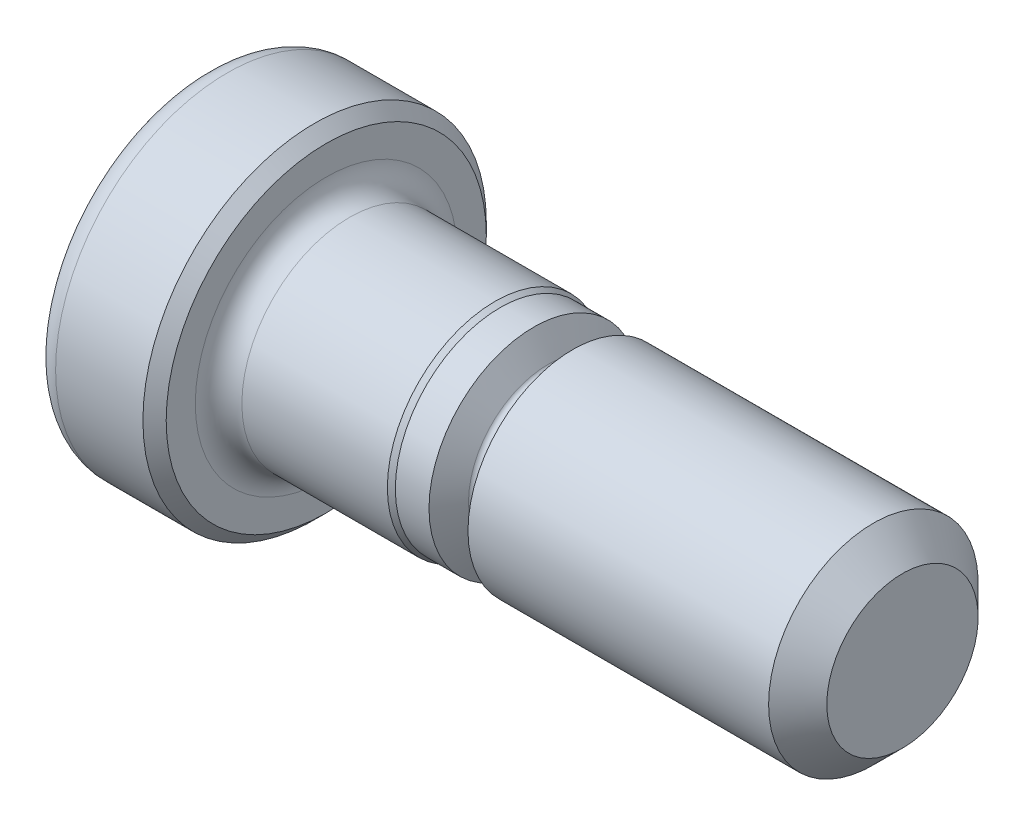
ISO-10303-21;
HEADER;
FILE_DESCRIPTION(('STEP AP214'),'2;1');
FILE_NAME('part.step','',(''),(''),'','','');
FILE_SCHEMA(('AUTOMOTIVE_DESIGN { 1 0 10303 214 1 1 1 1 }'));
ENDSEC;
DATA;
#1=APPLICATION_CONTEXT('core data for automotive mechanical design processes');
#2=APPLICATION_PROTOCOL_DEFINITION('international standard','automotive_design',2000,#1);
#3=PRODUCT_CONTEXT('',#1,'mechanical');
#4=PRODUCT('Part','Part','',(#3));
#5=PRODUCT_RELATED_PRODUCT_CATEGORY('part','',(#4));
#6=PRODUCT_DEFINITION_FORMATION('','',#4);
#7=PRODUCT_DEFINITION_CONTEXT('part definition',#1,'design');
#8=PRODUCT_DEFINITION('design','',#6,#7);
#9=PRODUCT_DEFINITION_SHAPE('','',#8);
#10=(LENGTH_UNIT() NAMED_UNIT(*) SI_UNIT(.MILLI.,.METRE.));
#11=(NAMED_UNIT(*) PLANE_ANGLE_UNIT() SI_UNIT($,.RADIAN.));
#12=(NAMED_UNIT(*) SI_UNIT($,.STERADIAN.) SOLID_ANGLE_UNIT());
#13=UNCERTAINTY_MEASURE_WITH_UNIT(LENGTH_MEASURE(1.E-05),#10,'distance_accuracy_value','');
#14=(GEOMETRIC_REPRESENTATION_CONTEXT(3) GLOBAL_UNCERTAINTY_ASSIGNED_CONTEXT((#13)) GLOBAL_UNIT_ASSIGNED_CONTEXT((#10,
#11,#12)) REPRESENTATION_CONTEXT('',''));
#15=CARTESIAN_POINT('',(0.,0.,0.));
#16=DIRECTION('',(0.,0.,1.));
#17=DIRECTION('',(1.,0.,0.));
#18=AXIS2_PLACEMENT_3D('',#15,#16,#17);
#19=CARTESIAN_POINT('',(0.,0.,0.));
#20=DIRECTION('',(1.,0.,0.));
#21=DIRECTION('',(0.,0.,-1.));
#22=AXIS2_PLACEMENT_3D('',#19,#20,#21);
#23=PLANE('',#22);
#24=CARTESIAN_POINT('',(0.,0.,0.));
#25=DIRECTION('',(1.,0.,0.));
#26=DIRECTION('',(0.,0.,-1.));
#27=AXIS2_PLACEMENT_3D('',#24,#25,#26);
#28=CIRCLE('',#27,1.275);
#29=CARTESIAN_POINT('',(0.,0.,-1.275));
#30=VERTEX_POINT('',#29);
#31=EDGE_CURVE('E290',#30,#30,#28,.F.);
#32=ORIENTED_EDGE('',*,*,#31,.T.);
#33=EDGE_LOOP('',(#32));
#34=FACE_BOUND('',#33,.T.);
#35=CARTESIAN_POINT('',(0.,0.,0.));
#36=DIRECTION('',(-1.,0.,0.));
#37=DIRECTION('',(0.,0.,1.));
#38=AXIS2_PLACEMENT_3D('',#35,#36,#37);
#39=CIRCLE('',#38,0.9);
#40=CARTESIAN_POINT('',(0.,0.,0.9));
#41=VERTEX_POINT('',#40);
#42=EDGE_CURVE('E263',#41,#41,#39,.T.);
#43=ORIENTED_EDGE('',*,*,#42,.F.);
#44=EDGE_LOOP('',(#43));
#45=FACE_BOUND('',#44,.T.);
#46=ADVANCED_FACE('F35',(#34,#45),#23,.F.);
#47=CARTESIAN_POINT('',(6.,0.65,0.));
#48=DIRECTION('',(-1.,0.,0.));
#49=DIRECTION('',(0.,0.,1.));
#50=AXIS2_PLACEMENT_3D('',#47,#48,#49);
#51=PLANE('',#50);
#52=CARTESIAN_POINT('',(6.,0.,0.));
#53=DIRECTION('',(-1.,0.,0.));
#54=DIRECTION('',(0.,0.,1.));
#55=AXIS2_PLACEMENT_3D('',#52,#53,#54);
#56=CIRCLE('',#55,0.65);
#57=CARTESIAN_POINT('',(6.,0.,0.65));
#58=VERTEX_POINT('',#57);
#59=EDGE_CURVE('E287',#58,#58,#56,.T.);
#60=ORIENTED_EDGE('',*,*,#59,.F.);
#61=EDGE_LOOP('',(#60));
#62=FACE_BOUND('',#61,.T.);
#63=ADVANCED_FACE('F402',(#62),#51,.F.);
#64=CARTESIAN_POINT('',(6.,0.,0.));
#65=DIRECTION('',(-1.,0.,0.));
#66=DIRECTION('',(0.,0.,1.));
#67=AXIS2_PLACEMENT_3D('',#64,#65,#66);
#68=CONICAL_SURFACE('',#67,0.65,0.785398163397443);
#69=CARTESIAN_POINT('',(5.75,0.,0.));
#70=DIRECTION('',(-1.,0.,0.));
#71=DIRECTION('',(0.,0.,1.));
#72=AXIS2_PLACEMENT_3D('',#69,#70,#71);
#73=CIRCLE('',#72,0.9);
#74=CARTESIAN_POINT('',(5.75,0.,0.9));
#75=VERTEX_POINT('',#74);
#76=EDGE_CURVE('E284',#75,#75,#73,.T.);
#77=ORIENTED_EDGE('',*,*,#76,.F.);
#78=EDGE_LOOP('',(#77));
#79=FACE_BOUND('',#78,.T.);
#80=ORIENTED_EDGE('',*,*,#59,.T.);
#81=EDGE_LOOP('',(#80));
#82=FACE_BOUND('',#81,.T.);
#83=ADVANCED_FACE('F407',(#79,#82),#68,.T.);
#84=CARTESIAN_POINT('',(0.,0.,0.));
#85=DIRECTION('',(-1.,0.,0.));
#86=DIRECTION('',(0.,0.,1.));
#87=AXIS2_PLACEMENT_3D('',#84,#85,#86);
#88=CYLINDRICAL_SURFACE('',#87,0.9);
#89=CARTESIAN_POINT('',(3.16743157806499,0.,0.));
#90=DIRECTION('',(-1.,0.,0.));
#91=DIRECTION('',(0.,0.,1.));
#92=AXIS2_PLACEMENT_3D('',#89,#90,#91);
#93=CIRCLE('',#92,0.9);
#94=CARTESIAN_POINT('',(3.16743157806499,0.,0.9));
#95=VERTEX_POINT('',#94);
#96=EDGE_CURVE('E281',#95,#95,#93,.T.);
#97=ORIENTED_EDGE('',*,*,#96,.F.);
#98=EDGE_LOOP('',(#97));
#99=FACE_BOUND('',#98,.T.);
#100=ORIENTED_EDGE('',*,*,#76,.T.);
#101=EDGE_LOOP('',(#100));
#102=FACE_BOUND('',#101,.T.);
#103=ADVANCED_FACE('F444',(#99,#102),#88,.T.);
#104=CARTESIAN_POINT('',(3.16743157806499,0.,0.));
#105=DIRECTION('',(1.,0.,0.));
#106=DIRECTION('',(0.,0.,-1.));
#107=AXIS2_PLACEMENT_3D('',#104,#105,#106);
#108=CONICAL_SURFACE('',#107,0.9,1.0471975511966);
#109=CARTESIAN_POINT('',(3.04330127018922,0.,0.));
#110=DIRECTION('',(-1.,0.,0.));
#111=DIRECTION('',(0.,0.,1.));
#112=AXIS2_PLACEMENT_3D('',#109,#110,#111);
#113=CIRCLE('',#112,0.685);
#114=CARTESIAN_POINT('',(3.04330127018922,0.,0.685));
#115=VERTEX_POINT('',#114);
#116=EDGE_CURVE('E278',#115,#115,#113,.T.);
#117=ORIENTED_EDGE('',*,*,#116,.F.);
#118=EDGE_LOOP('',(#117));
#119=FACE_BOUND('',#118,.T.);
#120=ORIENTED_EDGE('',*,*,#96,.T.);
#121=EDGE_LOOP('',(#120));
#122=FACE_BOUND('',#121,.T.);
#123=ADVANCED_FACE('F440',(#119,#122),#108,.T.);
#124=CARTESIAN_POINT('',(3.,0.,0.));
#125=DIRECTION('',(-1.,0.,0.));
#126=DIRECTION('',(0.,0.,1.));
#127=AXIS2_PLACEMENT_3D('',#124,#125,#126);
#128=TOROIDAL_SURFACE('',#127,0.71,0.0500000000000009);
#129=CARTESIAN_POINT('',(2.95669872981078,0.,0.));
#130=DIRECTION('',(-1.,0.,0.));
#131=DIRECTION('',(0.,0.,1.));
#132=AXIS2_PLACEMENT_3D('',#129,#130,#131);
#133=CIRCLE('',#132,0.685);
#134=CARTESIAN_POINT('',(2.95669872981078,0.,0.685));
#135=VERTEX_POINT('',#134);
#136=EDGE_CURVE('E275',#135,#135,#133,.T.);
#137=ORIENTED_EDGE('',*,*,#136,.F.);
#138=EDGE_LOOP('',(#137));
#139=FACE_BOUND('',#138,.T.);
#140=ORIENTED_EDGE('',*,*,#116,.T.);
#141=EDGE_LOOP('',(#140));
#142=FACE_BOUND('',#141,.T.);
#143=ADVANCED_FACE('F436',(#139,#142),#128,.F.);
#144=CARTESIAN_POINT('',(2.95669872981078,0.,0.));
#145=DIRECTION('',(-1.,0.,0.));
#146=DIRECTION('',(0.,0.,1.));
#147=AXIS2_PLACEMENT_3D('',#144,#145,#146);
#148=CONICAL_SURFACE('',#147,0.685,1.0471975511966);
#149=CARTESIAN_POINT('',(2.83256842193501,0.,0.));
#150=DIRECTION('',(-1.,0.,0.));
#151=DIRECTION('',(0.,0.,1.));
#152=AXIS2_PLACEMENT_3D('',#149,#150,#151);
#153=CIRCLE('',#152,0.9);
#154=CARTESIAN_POINT('',(2.83256842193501,0.,0.9));
#155=VERTEX_POINT('',#154);
#156=EDGE_CURVE('E272',#155,#155,#153,.T.);
#157=ORIENTED_EDGE('',*,*,#156,.F.);
#158=EDGE_LOOP('',(#157));
#159=FACE_BOUND('',#158,.T.);
#160=ORIENTED_EDGE('',*,*,#136,.T.);
#161=EDGE_LOOP('',(#160));
#162=FACE_BOUND('',#161,.T.);
#163=ADVANCED_FACE('F432',(#159,#162),#148,.T.);
#164=CARTESIAN_POINT('',(0.,0.,0.));
#165=DIRECTION('',(-1.,0.,0.));
#166=DIRECTION('',(0.,0.,1.));
#167=AXIS2_PLACEMENT_3D('',#164,#165,#166);
#168=CYLINDRICAL_SURFACE('',#167,0.9);
#169=CARTESIAN_POINT('',(2.54330127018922,0.,0.));
#170=DIRECTION('',(-1.,0.,0.));
#171=DIRECTION('',(0.,0.,1.));
#172=AXIS2_PLACEMENT_3D('',#169,#170,#171);
#173=CIRCLE('',#172,0.9);
#174=CARTESIAN_POINT('',(2.54330127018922,0.,0.9));
#175=VERTEX_POINT('',#174);
#176=EDGE_CURVE('E269',#175,#175,#173,.T.);
#177=ORIENTED_EDGE('',*,*,#176,.F.);
#178=EDGE_LOOP('',(#177));
#179=FACE_BOUND('',#178,.T.);
#180=ORIENTED_EDGE('',*,*,#156,.T.);
#181=EDGE_LOOP('',(#180));
#182=FACE_BOUND('',#181,.T.);
#183=ADVANCED_FACE('F428',(#179,#182),#168,.T.);
#184=CARTESIAN_POINT('',(2.54330127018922,0.,0.));
#185=DIRECTION('',(-1.,0.,0.));
#186=DIRECTION('',(0.,0.,1.));
#187=AXIS2_PLACEMENT_3D('',#184,#185,#186);
#188=CONICAL_SURFACE('',#187,0.9,0.523598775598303);
#189=CARTESIAN_POINT('',(2.5,0.,0.));
#190=DIRECTION('',(-1.,0.,0.));
#191=DIRECTION('',(0.,0.,1.));
#192=AXIS2_PLACEMENT_3D('',#189,#190,#191);
#193=CIRCLE('',#192,0.925);
#194=CARTESIAN_POINT('',(2.5,0.,0.925));
#195=VERTEX_POINT('',#194);
#196=EDGE_CURVE('E266',#195,#195,#193,.T.);
#197=ORIENTED_EDGE('',*,*,#196,.F.);
#198=EDGE_LOOP('',(#197));
#199=FACE_BOUND('',#198,.T.);
#200=ORIENTED_EDGE('',*,*,#176,.T.);
#201=EDGE_LOOP('',(#200));
#202=FACE_BOUND('',#201,.T.);
#203=ADVANCED_FACE('F424',(#199,#202),#188,.T.);
#204=CARTESIAN_POINT('',(0.,0.,0.));
#205=DIRECTION('',(-1.,0.,0.));
#206=DIRECTION('',(0.,0.,1.));
#207=AXIS2_PLACEMENT_3D('',#204,#205,#206);
#208=CYLINDRICAL_SURFACE('',#207,0.925);
#209=CARTESIAN_POINT('',(1.25,0.,0.));
#210=DIRECTION('',(-1.,0.,0.));
#211=DIRECTION('',(0.,0.,1.));
#212=AXIS2_PLACEMENT_3D('',#209,#210,#211);
#213=CIRCLE('',#212,0.925);
#214=CARTESIAN_POINT('',(1.25,0.,0.925));
#215=VERTEX_POINT('',#214);
#216=EDGE_CURVE('E299',#215,#215,#213,.F.);
#217=ORIENTED_EDGE('',*,*,#216,.T.);
#218=EDGE_LOOP('',(#217));
#219=FACE_BOUND('',#218,.T.);
#220=ORIENTED_EDGE('',*,*,#196,.T.);
#221=EDGE_LOOP('',(#220));
#222=FACE_BOUND('',#221,.T.);
#223=ADVANCED_FACE('F420',(#219,#222),#208,.T.);
#224=CARTESIAN_POINT('',(1.05,1.475,0.));
#225=DIRECTION('',(-1.,0.,0.));
#226=DIRECTION('',(0.,0.,1.));
#227=AXIS2_PLACEMENT_3D('',#224,#225,#226);
#228=PLANE('',#227);
#229=CARTESIAN_POINT('',(1.05,0.,0.));
#230=DIRECTION('',(-1.,0.,0.));
#231=DIRECTION('',(0.,0.,1.));
#232=AXIS2_PLACEMENT_3D('',#229,#230,#231);
#233=CIRCLE('',#232,1.375);
#234=CARTESIAN_POINT('',(1.05,0.,1.375));
#235=VERTEX_POINT('',#234);
#236=EDGE_CURVE('E305',#235,#235,#233,.F.);
#237=ORIENTED_EDGE('',*,*,#236,.T.);
#238=EDGE_LOOP('',(#237));
#239=FACE_BOUND('',#238,.T.);
#240=CARTESIAN_POINT('',(1.05,0.,0.));
#241=DIRECTION('',(-1.,0.,0.));
#242=DIRECTION('',(0.,0.,1.));
#243=AXIS2_PLACEMENT_3D('',#240,#241,#242);
#244=CIRCLE('',#243,1.125);
#245=CARTESIAN_POINT('',(1.05,0.,1.125));
#246=VERTEX_POINT('',#245);
#247=EDGE_CURVE('E296',#246,#246,#244,.T.);
#248=ORIENTED_EDGE('',*,*,#247,.T.);
#249=EDGE_LOOP('',(#248));
#250=FACE_BOUND('',#249,.T.);
#251=ADVANCED_FACE('F416',(#239,#250),#228,.F.);
#252=CARTESIAN_POINT('',(0.,0.,0.));
#253=DIRECTION('',(-1.,0.,0.));
#254=DIRECTION('',(0.,0.,1.));
#255=AXIS2_PLACEMENT_3D('',#252,#253,#254);
#256=CYLINDRICAL_SURFACE('',#255,1.475);
#257=CARTESIAN_POINT('',(0.95,0.,0.));
#258=DIRECTION('',(-1.,0.,0.));
#259=DIRECTION('',(0.,0.,1.));
#260=AXIS2_PLACEMENT_3D('',#257,#258,#259);
#261=CIRCLE('',#260,1.475);
#262=CARTESIAN_POINT('',(0.95,0.,1.475));
#263=VERTEX_POINT('',#262);
#264=EDGE_CURVE('E302',#263,#263,#261,.T.);
#265=ORIENTED_EDGE('',*,*,#264,.T.);
#266=EDGE_LOOP('',(#265));
#267=FACE_BOUND('',#266,.T.);
#268=CARTESIAN_POINT('',(0.2,0.,0.));
#269=DIRECTION('',(1.,0.,0.));
#270=DIRECTION('',(0.,0.,-1.));
#271=AXIS2_PLACEMENT_3D('',#268,#269,#270);
#272=CIRCLE('',#271,1.475);
#273=CARTESIAN_POINT('',(0.2,0.,-1.475));
#274=VERTEX_POINT('',#273);
#275=EDGE_CURVE('E293',#274,#274,#272,.T.);
#276=ORIENTED_EDGE('',*,*,#275,.T.);
#277=EDGE_LOOP('',(#276));
#278=FACE_BOUND('',#277,.T.);
#279=ADVANCED_FACE('F412',(#267,#278),#256,.T.);
#280=CARTESIAN_POINT('',(0.2,0.,0.));
#281=DIRECTION('',(1.,0.,0.));
#282=DIRECTION('',(0.,0.,-1.));
#283=AXIS2_PLACEMENT_3D('',#280,#281,#282);
#284=TOROIDAL_SURFACE('',#283,1.275,0.2);
#285=ORIENTED_EDGE('',*,*,#275,.F.);
#286=EDGE_LOOP('',(#285));
#287=FACE_BOUND('',#286,.T.);
#288=ORIENTED_EDGE('',*,*,#31,.F.);
#289=EDGE_LOOP('',(#288));
#290=FACE_BOUND('',#289,.T.);
#291=ADVANCED_FACE('F415',(#287,#290),#284,.T.);
#292=CARTESIAN_POINT('',(1.25,0.,0.));
#293=DIRECTION('',(-1.,0.,0.));
#294=DIRECTION('',(0.,0.,1.));
#295=AXIS2_PLACEMENT_3D('',#292,#293,#294);
#296=TOROIDAL_SURFACE('',#295,1.125,0.2);
#297=ORIENTED_EDGE('',*,*,#216,.F.);
#298=EDGE_LOOP('',(#297));
#299=FACE_BOUND('',#298,.T.);
#300=ORIENTED_EDGE('',*,*,#247,.F.);
#301=EDGE_LOOP('',(#300));
#302=FACE_BOUND('',#301,.T.);
#303=ADVANCED_FACE('F453',(#299,#302),#296,.F.);
#304=CARTESIAN_POINT('',(0.95,0.,0.));
#305=DIRECTION('',(-1.,0.,0.));
#306=DIRECTION('',(0.,0.,1.));
#307=AXIS2_PLACEMENT_3D('',#304,#305,#306);
#308=CONICAL_SURFACE('',#307,1.475,0.785398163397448);
#309=ORIENTED_EDGE('',*,*,#236,.F.);
#310=EDGE_LOOP('',(#309));
#311=FACE_BOUND('',#310,.T.);
#312=ORIENTED_EDGE('',*,*,#264,.F.);
#313=EDGE_LOOP('',(#312));
#314=FACE_BOUND('',#313,.T.);
#315=ADVANCED_FACE('F37',(#311,#314),#308,.T.);
#316=CARTESIAN_POINT('',(0.249999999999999,0.,0.));
#317=DIRECTION('',(-1.,0.,0.));
#318=DIRECTION('',(0.,0.,1.));
#319=AXIS2_PLACEMENT_3D('',#316,#317,#318);
#320=CONICAL_SURFACE('',#319,0.65,0.78539816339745);
#321=CARTESIAN_POINT('',(-0.212714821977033,0.0991369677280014,1.10828973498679));
#322=CARTESIAN_POINT('',(-0.184792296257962,0.116220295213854,1.07870054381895));
#323=CARTESIAN_POINT('',(-0.157145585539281,0.133421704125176,1.04890682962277));
#324=CARTESIAN_POINT('',(-0.102654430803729,0.168186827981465,0.988691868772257));
#325=CARTESIAN_POINT('',(-0.0758114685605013,0.185751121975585,0.958269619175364));
#326=CARTESIAN_POINT('',(-0.0226460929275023,0.221736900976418,0.895940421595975));
#327=CARTESIAN_POINT('',(0.00364827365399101,0.240168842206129,0.864015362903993));
#328=CARTESIAN_POINT('',(0.0544559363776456,0.27762357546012,0.799141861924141));
#329=CARTESIAN_POINT('',(0.0789704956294,0.296645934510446,0.766194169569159));
#330=CARTESIAN_POINT('',(0.128418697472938,0.338044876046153,0.69448909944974));
#331=CARTESIAN_POINT('',(0.152984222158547,0.360533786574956,0.655537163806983));
#332=CARTESIAN_POINT('',(0.196462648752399,0.40676600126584,0.575460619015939));
#333=CARTESIAN_POINT('',(0.215405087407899,0.430501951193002,0.534348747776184));
#334=CARTESIAN_POINT('',(0.240821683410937,0.47339976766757,0.460047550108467));
#335=CARTESIAN_POINT('',(0.2492097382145,0.49226588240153,0.427370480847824));
#336=CARTESIAN_POINT('',(0.259330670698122,0.53041549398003,0.361293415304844));
#337=CARTESIAN_POINT('',(0.261081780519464,0.549697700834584,0.327895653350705));
#338=CARTESIAN_POINT('',(0.257580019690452,0.588087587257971,0.261402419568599));
#339=CARTESIAN_POINT('',(0.25232855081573,0.607195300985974,0.228306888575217));
#340=CARTESIAN_POINT('',(0.23589971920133,0.644796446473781,0.163179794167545));
#341=CARTESIAN_POINT('',(0.224701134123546,0.663287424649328,0.131152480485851));
#342=CARTESIAN_POINT('',(0.194819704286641,0.703774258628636,0.0610272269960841));
#343=CARTESIAN_POINT('',(0.174987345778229,0.725550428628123,0.0233097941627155));
#344=CARTESIAN_POINT('',(0.131167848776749,0.768050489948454,-0.050302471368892));
#345=CARTESIAN_POINT('',(0.107171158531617,0.788771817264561,-0.086192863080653));
#346=CARTESIAN_POINT('',(0.0564162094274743,0.829506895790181,-0.156748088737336));
#347=CARTESIAN_POINT('',(0.0296425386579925,0.849515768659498,-0.191404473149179));
#348=CARTESIAN_POINT('',(-0.0256130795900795,0.888899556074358,-0.259619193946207));
#349=CARTESIAN_POINT('',(-0.0540934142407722,0.908275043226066,-0.293178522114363));
#350=CARTESIAN_POINT('',(-0.104310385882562,0.941350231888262,-0.350466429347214));
#351=CARTESIAN_POINT('',(-0.125767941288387,0.955156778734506,-0.374380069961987));
#352=CARTESIAN_POINT('',(-0.168997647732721,0.98245810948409,-0.42166736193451));
#353=CARTESIAN_POINT('',(-0.190765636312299,0.995954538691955,-0.445043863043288));
#354=CARTESIAN_POINT('',(-0.212714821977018,1.00937554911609,-0.468289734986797));
#355=B_SPLINE_CURVE_WITH_KNOTS('',3,(#321,#322,#323,#324,#325,#326,#327,#328,#329,#330,#331,
#332,#333,#334,#335,#336,#337,#338,#339,#340,#341,#342,#343,#344,#345,#346,#347,#348,#349,#350,
#351,#352,#353,#354),.UNSPECIFIED.,.F.,.F.,(4,2,2,2,2,2,2,2,2,2,2,2,2,2,2,2,4),(0.,
0.132386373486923,0.265003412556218,0.400810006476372,0.536519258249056,0.690058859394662,
0.842777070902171,0.958260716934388,1.07342689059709,1.1885700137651,1.3041268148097,
1.44732611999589,1.59085833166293,1.73523471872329,1.87947675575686,1.98438169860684,
2.08840453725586),.UNSPECIFIED.);
#356=CARTESIAN_POINT('',(0.160991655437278,0.369504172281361,0.64));
#357=VERTEX_POINT('',#356);
#358=CARTESIAN_POINT('',(0.249999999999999,0.497467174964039,0.418361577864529));
#359=VERTEX_POINT('',#358);
#360=EDGE_CURVE('E242',#357,#359,#355,.T.);
#361=ORIENTED_EDGE('',*,*,#360,.F.);
#362=CARTESIAN_POINT('',(-0.15427635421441,-0.837793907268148,0.64));
#363=CARTESIAN_POINT('',(-0.125480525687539,-0.801499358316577,0.64));
#364=CARTESIAN_POINT('',(-0.0970433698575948,-0.764897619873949,0.64));
#365=CARTESIAN_POINT('',(-0.0412546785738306,-0.690643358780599,0.64));
#366=CARTESIAN_POINT('',(-0.0139080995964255,-0.65298712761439,0.64));
#367=CARTESIAN_POINT('',(0.0401547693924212,-0.574938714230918,0.64));
#368=CARTESIAN_POINT('',(0.0668011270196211,-0.534497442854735,0.64));
#369=CARTESIAN_POINT('',(0.117212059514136,-0.451916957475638,0.64));
#370=CARTESIAN_POINT('',(0.140981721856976,-0.409780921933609,0.64));
#371=CARTESIAN_POINT('',(0.182221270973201,-0.326791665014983,0.64));
#372=CARTESIAN_POINT('',(0.200050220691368,-0.286122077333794,0.64));
#373=CARTESIAN_POINT('',(0.229700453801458,-0.202941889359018,0.64));
#374=CARTESIAN_POINT('',(0.241574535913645,-0.160451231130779,0.64));
#375=CARTESIAN_POINT('',(0.256017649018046,-0.0801870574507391,0.64));
#376=CARTESIAN_POINT('',(0.259684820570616,-0.0426210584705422,0.64));
#377=CARTESIAN_POINT('',(0.260275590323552,0.0325537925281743,0.64));
#378=CARTESIAN_POINT('',(0.257201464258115,0.0701626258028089,0.64));
#379=CARTESIAN_POINT('',(0.24314972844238,0.155238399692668,0.64));
#380=CARTESIAN_POINT('',(0.230112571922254,0.202349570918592,0.64));
#381=CARTESIAN_POINT('',(0.196877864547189,0.294395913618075,0.64));
#382=CARTESIAN_POINT('',(0.176599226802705,0.339299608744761,0.64));
#383=CARTESIAN_POINT('',(0.132729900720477,0.424705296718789,0.64));
#384=CARTESIAN_POINT('',(0.109342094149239,0.4653150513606,0.64));
#385=CARTESIAN_POINT('',(0.0599818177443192,0.544984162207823,0.64));
#386=CARTESIAN_POINT('',(0.0340057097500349,0.584041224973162,0.64));
#387=CARTESIAN_POINT('',(-0.0185115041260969,0.659366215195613,0.64));
#388=CARTESIAN_POINT('',(-0.0449840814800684,0.695682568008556,0.64));
#389=CARTESIAN_POINT('',(-0.0989522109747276,0.767358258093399,0.64));
#390=CARTESIAN_POINT('',(-0.126444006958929,0.802720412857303,0.64));
#391=CARTESIAN_POINT('',(-0.15427635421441,0.837793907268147,0.64));
#392=B_SPLINE_CURVE_WITH_KNOTS('',3,(#362,#363,#364,#365,#366,#367,#368,#369,#370,#371,#372,
#373,#374,#375,#376,#377,#378,#379,#380,#381,#382,#383,#384,#385,#386,#387,#388,#389,#390,#391),
.UNSPECIFIED.,.F.,.F.,(4,2,2,2,2,2,2,2,2,2,2,2,2,2,4),(0.,0.139015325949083,0.278603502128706,
0.423822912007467,0.56878162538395,0.701713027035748,0.83344398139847,0.946106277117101,
1.05873054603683,1.2044966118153,1.35194890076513,1.4924026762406,1.6330567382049,
1.76785590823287,1.90219989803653),.UNSPECIFIED.);
#393=CARTESIAN_POINT('',(0.249999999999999,0.113578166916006,0.64));
#394=VERTEX_POINT('',#393);
#395=EDGE_CURVE('E248',#394,#357,#392,.T.);
#396=ORIENTED_EDGE('',*,*,#395,.F.);
#397=CARTESIAN_POINT('',(0.249999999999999,0.,0.));
#398=DIRECTION('',(-1.,0.,0.));
#399=DIRECTION('',(0.,0.,1.));
#400=AXIS2_PLACEMENT_3D('',#397,#398,#399);
#401=CIRCLE('',#400,0.65);
#402=CARTESIAN_POINT('',(0.249999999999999,-0.113578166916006,0.64));
#403=VERTEX_POINT('',#402);
#404=EDGE_CURVE('E258',#403,#394,#401,.T.);
#405=ORIENTED_EDGE('',*,*,#404,.F.);
#406=CARTESIAN_POINT('',(0.160991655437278,-0.369504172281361,0.64));
#407=VERTEX_POINT('',#406);
#408=EDGE_CURVE('E249',#407,#403,#392,.T.);
#409=ORIENTED_EDGE('',*,*,#408,.F.);
#410=CARTESIAN_POINT('',(-0.212714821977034,-1.00937554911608,-0.468289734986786));
#411=CARTESIAN_POINT('',(-0.184792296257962,-0.992292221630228,-0.438700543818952));
#412=CARTESIAN_POINT('',(-0.157145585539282,-0.975090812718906,-0.408906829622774));
#413=CARTESIAN_POINT('',(-0.102654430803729,-0.940325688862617,-0.348691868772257));
#414=CARTESIAN_POINT('',(-0.0758114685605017,-0.922761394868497,-0.318269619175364));
#415=CARTESIAN_POINT('',(-0.0226460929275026,-0.886775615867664,-0.255940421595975));
#416=CARTESIAN_POINT('',(0.00364827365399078,-0.868343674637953,-0.224015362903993));
#417=CARTESIAN_POINT('',(0.0544559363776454,-0.830888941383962,-0.159141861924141));
#418=CARTESIAN_POINT('',(0.0789704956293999,-0.811866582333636,-0.126194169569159));
#419=CARTESIAN_POINT('',(0.128418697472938,-0.770467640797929,-0.05448909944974));
#420=CARTESIAN_POINT('',(0.152984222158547,-0.747978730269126,-0.0155371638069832));
#421=CARTESIAN_POINT('',(0.196462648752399,-0.701746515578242,0.0645393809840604));
#422=CARTESIAN_POINT('',(0.215405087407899,-0.67801056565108,0.105651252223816));
#423=CARTESIAN_POINT('',(0.240821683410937,-0.635112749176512,0.179952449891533));
#424=CARTESIAN_POINT('',(0.2492097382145,-0.616246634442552,0.212629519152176));
#425=CARTESIAN_POINT('',(0.259330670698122,-0.578097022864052,0.278706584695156));
#426=CARTESIAN_POINT('',(0.261081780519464,-0.558814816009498,0.312104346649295));
#427=CARTESIAN_POINT('',(0.257580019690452,-0.520424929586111,0.378597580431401));
#428=CARTESIAN_POINT('',(0.252328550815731,-0.501317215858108,0.411693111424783));
#429=CARTESIAN_POINT('',(0.23589971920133,-0.463716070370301,0.476820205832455));
#430=CARTESIAN_POINT('',(0.224701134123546,-0.445225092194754,0.508847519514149));
#431=CARTESIAN_POINT('',(0.194819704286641,-0.404738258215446,0.578972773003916));
#432=CARTESIAN_POINT('',(0.174987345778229,-0.38296208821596,0.616690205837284));
#433=CARTESIAN_POINT('',(0.131167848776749,-0.340462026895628,0.690302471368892));
#434=CARTESIAN_POINT('',(0.107171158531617,-0.319740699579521,0.726192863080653));
#435=CARTESIAN_POINT('',(0.0564162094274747,-0.279005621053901,0.796748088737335));
#436=CARTESIAN_POINT('',(0.0296425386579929,-0.258996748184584,0.831404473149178));
#437=CARTESIAN_POINT('',(-0.025613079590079,-0.219612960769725,0.899619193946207));
#438=CARTESIAN_POINT('',(-0.0540934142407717,-0.200237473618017,0.933178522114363));
#439=CARTESIAN_POINT('',(-0.104310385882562,-0.16716228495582,0.990466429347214));
#440=CARTESIAN_POINT('',(-0.125767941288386,-0.153355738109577,1.01438006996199));
#441=CARTESIAN_POINT('',(-0.16899764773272,-0.126054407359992,1.06166736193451));
#442=CARTESIAN_POINT('',(-0.190765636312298,-0.112557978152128,1.08504386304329));
#443=CARTESIAN_POINT('',(-0.212714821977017,-0.0991369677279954,1.1082897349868));
#444=B_SPLINE_CURVE_WITH_KNOTS('',3,(#410,#411,#412,#413,#414,#415,#416,#417,#418,#419,#420,
#421,#422,#423,#424,#425,#426,#427,#428,#429,#430,#431,#432,#433,#434,#435,#436,#437,#438,#439,
#440,#441,#442,#443),.UNSPECIFIED.,.F.,.F.,(4,2,2,2,2,2,2,2,2,2,2,2,2,2,2,2,4),(0.,
0.132386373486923,0.265003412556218,0.400810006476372,0.536519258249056,0.690058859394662,
0.842777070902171,0.958260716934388,1.07342689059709,1.1885700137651,1.3041268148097,
1.44732611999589,1.59085833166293,1.73523471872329,1.87947675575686,1.98438169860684,
2.08840453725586),.UNSPECIFIED.);
#445=CARTESIAN_POINT('',(0.249999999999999,-0.497467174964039,0.418361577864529));
#446=VERTEX_POINT('',#445);
#447=EDGE_CURVE('E372',#446,#407,#444,.T.);
#448=ORIENTED_EDGE('',*,*,#447,.F.);
#449=CARTESIAN_POINT('',(0.249999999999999,-0.611045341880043,0.221638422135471));
#450=VERTEX_POINT('',#449);
#451=EDGE_CURVE('E261',#450,#446,#401,.T.);
#452=ORIENTED_EDGE('',*,*,#451,.F.);
#453=CARTESIAN_POINT('',(0.160991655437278,-0.739008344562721,0.));
#454=VERTEX_POINT('',#453);
#455=EDGE_CURVE('E370',#454,#450,#444,.T.);
#456=ORIENTED_EDGE('',*,*,#455,.F.);
#457=CARTESIAN_POINT('',(-0.212714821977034,-0.0991369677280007,-1.10828973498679));
#458=CARTESIAN_POINT('',(-0.184792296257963,-0.116220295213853,-1.07870054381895));
#459=CARTESIAN_POINT('',(-0.157145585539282,-0.133421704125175,-1.04890682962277));
#460=CARTESIAN_POINT('',(-0.10265443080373,-0.168186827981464,-0.988691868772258));
#461=CARTESIAN_POINT('',(-0.0758114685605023,-0.185751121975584,-0.958269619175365));
#462=CARTESIAN_POINT('',(-0.0226460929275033,-0.221736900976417,-0.895940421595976));
#463=CARTESIAN_POINT('',(0.00364827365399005,-0.240168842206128,-0.864015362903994));
#464=CARTESIAN_POINT('',(0.0544559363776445,-0.277623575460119,-0.799141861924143));
#465=CARTESIAN_POINT('',(0.0789704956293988,-0.296645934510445,-0.76619416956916));
#466=CARTESIAN_POINT('',(0.128418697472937,-0.338044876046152,-0.694489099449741));
#467=CARTESIAN_POINT('',(0.152984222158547,-0.360533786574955,-0.655537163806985));
#468=CARTESIAN_POINT('',(0.196462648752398,-0.406766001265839,-0.575460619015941));
#469=CARTESIAN_POINT('',(0.215405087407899,-0.430501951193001,-0.534348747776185));
#470=CARTESIAN_POINT('',(0.240821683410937,-0.47339976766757,-0.460047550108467));
#471=CARTESIAN_POINT('',(0.2492097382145,-0.49226588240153,-0.427370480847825));
#472=CARTESIAN_POINT('',(0.259330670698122,-0.53041549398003,-0.361293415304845));
#473=CARTESIAN_POINT('',(0.261081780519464,-0.549697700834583,-0.327895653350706));
#474=CARTESIAN_POINT('',(0.257580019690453,-0.58808758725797,-0.2614024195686));
#475=CARTESIAN_POINT('',(0.252328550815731,-0.607195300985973,-0.228306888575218));
#476=CARTESIAN_POINT('',(0.23589971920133,-0.644796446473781,-0.163179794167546));
#477=CARTESIAN_POINT('',(0.224701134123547,-0.663287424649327,-0.131152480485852));
#478=CARTESIAN_POINT('',(0.194819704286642,-0.703774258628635,-0.0610272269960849));
#479=CARTESIAN_POINT('',(0.17498734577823,-0.725550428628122,-0.0233097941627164));
#480=CARTESIAN_POINT('',(0.131167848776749,-0.768050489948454,0.0503024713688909));
#481=CARTESIAN_POINT('',(0.107171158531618,-0.78877181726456,0.0861928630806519));
#482=CARTESIAN_POINT('',(0.0564162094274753,-0.829506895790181,0.156748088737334));
#483=CARTESIAN_POINT('',(0.0296425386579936,-0.849515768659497,0.191404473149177));
#484=CARTESIAN_POINT('',(-0.0256130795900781,-0.888899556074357,0.259619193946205));
#485=CARTESIAN_POINT('',(-0.0540934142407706,-0.908275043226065,0.293178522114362));
#486=CARTESIAN_POINT('',(-0.104310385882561,-0.941350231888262,0.350466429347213));
#487=CARTESIAN_POINT('',(-0.125767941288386,-0.955156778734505,0.374380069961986));
#488=CARTESIAN_POINT('',(-0.16899764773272,-0.98245810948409,0.42166736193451));
#489=CARTESIAN_POINT('',(-0.190765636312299,-0.995954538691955,0.445043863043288));
#490=CARTESIAN_POINT('',(-0.212714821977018,-1.00937554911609,0.468289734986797));
#491=B_SPLINE_CURVE_WITH_KNOTS('',3,(#457,#458,#459,#460,#461,#462,#463,#464,#465,#466,#467,
#468,#469,#470,#471,#472,#473,#474,#475,#476,#477,#478,#479,#480,#481,#482,#483,#484,#485,#486,
#487,#488,#489,#490),.UNSPECIFIED.,.F.,.F.,(4,2,2,2,2,2,2,2,2,2,2,2,2,2,2,2,4),(0.,
0.132386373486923,0.265003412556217,0.400810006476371,0.536519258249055,0.690058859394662,
0.842777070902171,0.958260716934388,1.07342689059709,1.1885700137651,1.3041268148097,
1.44732611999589,1.59085833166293,1.73523471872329,1.87947675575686,1.98438169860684,
2.08840453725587),.UNSPECIFIED.);
#492=CARTESIAN_POINT('',(0.249999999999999,-0.611045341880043,-0.221638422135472));
#493=VERTEX_POINT('',#492);
#494=EDGE_CURVE('E366',#493,#454,#491,.T.);
#495=ORIENTED_EDGE('',*,*,#494,.F.);
#496=CARTESIAN_POINT('',(0.249999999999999,-0.497467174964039,-0.418361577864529));
#497=VERTEX_POINT('',#496);
#498=EDGE_CURVE('E506',#497,#493,#401,.T.);
#499=ORIENTED_EDGE('',*,*,#498,.F.);
#500=CARTESIAN_POINT('',(0.160991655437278,-0.36950417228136,-0.64));
#501=VERTEX_POINT('',#500);
#502=EDGE_CURVE('E373',#501,#497,#491,.T.);
#503=ORIENTED_EDGE('',*,*,#502,.F.);
#504=CARTESIAN_POINT('',(-0.15427635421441,0.837793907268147,-0.64));
#505=CARTESIAN_POINT('',(-0.125480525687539,0.801499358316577,-0.64));
#506=CARTESIAN_POINT('',(-0.0970433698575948,0.764897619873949,-0.64));
#507=CARTESIAN_POINT('',(-0.0412546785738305,0.690643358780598,-0.64));
#508=CARTESIAN_POINT('',(-0.0139080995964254,0.652987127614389,-0.64));
#509=CARTESIAN_POINT('',(0.0401547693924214,0.574938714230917,-0.64));
#510=CARTESIAN_POINT('',(0.0668011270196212,0.534497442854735,-0.64));
#511=CARTESIAN_POINT('',(0.117212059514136,0.451916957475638,-0.64));
#512=CARTESIAN_POINT('',(0.140981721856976,0.409780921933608,-0.64));
#513=CARTESIAN_POINT('',(0.182221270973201,0.326791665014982,-0.64));
#514=CARTESIAN_POINT('',(0.200050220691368,0.286122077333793,-0.64));
#515=CARTESIAN_POINT('',(0.229700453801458,0.202941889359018,-0.64));
#516=CARTESIAN_POINT('',(0.241574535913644,0.160451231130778,-0.64));
#517=CARTESIAN_POINT('',(0.256017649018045,0.0801870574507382,-0.64));
#518=CARTESIAN_POINT('',(0.259684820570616,0.0426210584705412,-0.64));
#519=CARTESIAN_POINT('',(0.260275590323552,-0.0325537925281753,-0.64));
#520=CARTESIAN_POINT('',(0.257201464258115,-0.0701626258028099,-0.64));
#521=CARTESIAN_POINT('',(0.243149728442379,-0.155238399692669,-0.64));
#522=CARTESIAN_POINT('',(0.230112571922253,-0.202349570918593,-0.64));
#523=CARTESIAN_POINT('',(0.196877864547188,-0.294395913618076,-0.64));
#524=CARTESIAN_POINT('',(0.176599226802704,-0.339299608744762,-0.64));
#525=CARTESIAN_POINT('',(0.132729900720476,-0.42470529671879,-0.64));
#526=CARTESIAN_POINT('',(0.109342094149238,-0.465315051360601,-0.64));
#527=CARTESIAN_POINT('',(0.0599818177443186,-0.544984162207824,-0.64));
#528=CARTESIAN_POINT('',(0.0340057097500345,-0.584041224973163,-0.64));
#529=CARTESIAN_POINT('',(-0.0185115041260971,-0.659366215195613,-0.64));
#530=CARTESIAN_POINT('',(-0.0449840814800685,-0.695682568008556,-0.64));
#531=CARTESIAN_POINT('',(-0.0989522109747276,-0.767358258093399,-0.64));
#532=CARTESIAN_POINT('',(-0.126444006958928,-0.802720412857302,-0.64));
#533=CARTESIAN_POINT('',(-0.15427635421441,-0.837793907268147,-0.64));
#534=B_SPLINE_CURVE_WITH_KNOTS('',3,(#504,#505,#506,#507,#508,#509,#510,#511,#512,#513,#514,
#515,#516,#517,#518,#519,#520,#521,#522,#523,#524,#525,#526,#527,#528,#529,#530,#531,#532,#533),
.UNSPECIFIED.,.F.,.F.,(4,2,2,2,2,2,2,2,2,2,2,2,2,2,4),(0.,0.139015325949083,0.278603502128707,
0.423822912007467,0.568781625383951,0.701713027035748,0.83344398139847,0.946106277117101,
1.05873054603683,1.2044966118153,1.35194890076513,1.4924026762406,1.6330567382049,
1.76785590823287,1.90219989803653),.UNSPECIFIED.);
#535=CARTESIAN_POINT('',(0.249999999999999,-0.113578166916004,-0.64));
#536=VERTEX_POINT('',#535);
#537=EDGE_CURVE('E540',#536,#501,#534,.T.);
#538=ORIENTED_EDGE('',*,*,#537,.F.);
#539=CARTESIAN_POINT('',(0.249999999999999,0.113578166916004,-0.64));
#540=VERTEX_POINT('',#539);
#541=EDGE_CURVE('E503',#540,#536,#401,.T.);
#542=ORIENTED_EDGE('',*,*,#541,.F.);
#543=CARTESIAN_POINT('',(0.160991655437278,0.369504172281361,-0.64));
#544=VERTEX_POINT('',#543);
#545=EDGE_CURVE('E217',#544,#540,#534,.T.);
#546=ORIENTED_EDGE('',*,*,#545,.F.);
#547=CARTESIAN_POINT('',(-0.212714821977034,1.00937554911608,0.468289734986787));
#548=CARTESIAN_POINT('',(-0.184792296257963,0.992292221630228,0.438700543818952));
#549=CARTESIAN_POINT('',(-0.157145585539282,0.975090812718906,0.408906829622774));
#550=CARTESIAN_POINT('',(-0.102654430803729,0.940325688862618,0.348691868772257));
#551=CARTESIAN_POINT('',(-0.0758114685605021,0.922761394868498,0.318269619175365));
#552=CARTESIAN_POINT('',(-0.022646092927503,0.886775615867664,0.255940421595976));
#553=CARTESIAN_POINT('',(0.00364827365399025,0.868343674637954,0.224015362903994));
#554=CARTESIAN_POINT('',(0.0544559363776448,0.830888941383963,0.159141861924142));
#555=CARTESIAN_POINT('',(0.0789704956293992,0.811866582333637,0.12619416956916));
#556=CARTESIAN_POINT('',(0.128418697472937,0.770467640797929,0.0544890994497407));
#557=CARTESIAN_POINT('',(0.152984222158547,0.747978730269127,0.0155371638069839));
#558=CARTESIAN_POINT('',(0.196462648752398,0.701746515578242,-0.0645393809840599));
#559=CARTESIAN_POINT('',(0.215405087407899,0.67801056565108,-0.105651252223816));
#560=CARTESIAN_POINT('',(0.240821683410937,0.635112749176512,-0.179952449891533));
#561=CARTESIAN_POINT('',(0.2492097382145,0.616246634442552,-0.212629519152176));
#562=CARTESIAN_POINT('',(0.259330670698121,0.578097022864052,-0.278706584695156));
#563=CARTESIAN_POINT('',(0.261081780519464,0.558814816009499,-0.312104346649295));
#564=CARTESIAN_POINT('',(0.257580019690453,0.520424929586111,-0.3785975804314));
#565=CARTESIAN_POINT('',(0.252328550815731,0.501317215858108,-0.411693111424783));
#566=CARTESIAN_POINT('',(0.23589971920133,0.463716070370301,-0.476820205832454));
#567=CARTESIAN_POINT('',(0.224701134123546,0.445225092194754,-0.508847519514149));
#568=CARTESIAN_POINT('',(0.194819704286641,0.404738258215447,-0.578972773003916));
#569=CARTESIAN_POINT('',(0.174987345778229,0.38296208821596,-0.616690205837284));
#570=CARTESIAN_POINT('',(0.131167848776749,0.340462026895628,-0.690302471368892));
#571=CARTESIAN_POINT('',(0.107171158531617,0.319740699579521,-0.726192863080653));
#572=CARTESIAN_POINT('',(0.0564162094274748,0.279005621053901,-0.796748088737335));
#573=CARTESIAN_POINT('',(0.029642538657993,0.258996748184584,-0.831404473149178));
#574=CARTESIAN_POINT('',(-0.0256130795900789,0.219612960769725,-0.899619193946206));
#575=CARTESIAN_POINT('',(-0.0540934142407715,0.200237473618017,-0.933178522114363));
#576=CARTESIAN_POINT('',(-0.104310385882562,0.16716228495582,-0.990466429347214));
#577=CARTESIAN_POINT('',(-0.125767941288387,0.153355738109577,-1.01438006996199));
#578=CARTESIAN_POINT('',(-0.168997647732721,0.126054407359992,-1.06166736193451));
#579=CARTESIAN_POINT('',(-0.190765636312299,0.112557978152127,-1.08504386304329));
#580=CARTESIAN_POINT('',(-0.212714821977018,0.0991369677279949,-1.1082897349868));
#581=B_SPLINE_CURVE_WITH_KNOTS('',3,(#547,#548,#549,#550,#551,#552,#553,#554,#555,#556,#557,
#558,#559,#560,#561,#562,#563,#564,#565,#566,#567,#568,#569,#570,#571,#572,#573,#574,#575,#576,
#577,#578,#579,#580),.UNSPECIFIED.,.F.,.F.,(4,2,2,2,2,2,2,2,2,2,2,2,2,2,2,2,4),(0.,
0.132386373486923,0.265003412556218,0.400810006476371,0.536519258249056,0.690058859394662,
0.842777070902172,0.958260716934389,1.07342689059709,1.1885700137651,1.3041268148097,
1.44732611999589,1.59085833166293,1.73523471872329,1.87947675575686,1.98438169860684,
2.08840453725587),.UNSPECIFIED.);
#582=CARTESIAN_POINT('',(0.249999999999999,0.497467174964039,-0.418361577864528));
#583=VERTEX_POINT('',#582);
#584=EDGE_CURVE('E216',#583,#544,#581,.T.);
#585=ORIENTED_EDGE('',*,*,#584,.F.);
#586=CARTESIAN_POINT('',(0.249999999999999,0.611045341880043,-0.221638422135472));
#587=VERTEX_POINT('',#586);
#588=EDGE_CURVE('E501',#587,#583,#401,.T.);
#589=ORIENTED_EDGE('',*,*,#588,.F.);
#590=CARTESIAN_POINT('',(0.160991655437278,0.739008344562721,0.));
#591=VERTEX_POINT('',#590);
#592=EDGE_CURVE('E198',#591,#587,#581,.T.);
#593=ORIENTED_EDGE('',*,*,#592,.F.);
#594=CARTESIAN_POINT('',(0.249999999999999,0.611045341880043,0.221638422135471));
#595=VERTEX_POINT('',#594);
#596=EDGE_CURVE('E172',#595,#591,#355,.T.);
#597=ORIENTED_EDGE('',*,*,#596,.F.);
#598=EDGE_CURVE('E262',#359,#595,#401,.T.);
#599=ORIENTED_EDGE('',*,*,#598,.F.);
#600=EDGE_LOOP('',(#361,#396,#405,#409,#448,#452,#456,#495,#499,#503,#538,#542,#546,#585,#589,
#593,#597,#599));
#601=FACE_BOUND('',#600,.T.);
#602=ORIENTED_EDGE('',*,*,#42,.T.);
#603=EDGE_LOOP('',(#602));
#604=FACE_BOUND('',#603,.T.);
#605=ADVANCED_FACE('F223',(#601,#604),#320,.F.);
#606=CARTESIAN_POINT('',(0.,0.,0.));
#607=DIRECTION('',(-1.,0.,0.));
#608=DIRECTION('',(0.,0.,1.));
#609=AXIS2_PLACEMENT_3D('',#606,#607,#608);
#610=CYLINDRICAL_SURFACE('',#609,0.65);
#611=DIRECTION('',(-1.,0.,0.));
#612=VECTOR('',#611,1.);
#613=CARTESIAN_POINT('',(0.,0.497467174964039,0.418361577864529));
#614=LINE('',#613,#612);
#615=CARTESIAN_POINT('',(1.3,0.497467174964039,0.418361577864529));
#616=VERTEX_POINT('',#615);
#617=EDGE_CURVE('E11',#359,#616,#614,.F.);
#618=ORIENTED_EDGE('',*,*,#617,.F.);
#619=ORIENTED_EDGE('',*,*,#598,.T.);
#620=DIRECTION('',(-1.,0.,0.));
#621=VECTOR('',#620,1.);
#622=CARTESIAN_POINT('',(0.,0.611045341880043,0.221638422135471));
#623=LINE('',#622,#621);
#624=CARTESIAN_POINT('',(1.3,0.611045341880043,0.221638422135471));
#625=VERTEX_POINT('',#624);
#626=EDGE_CURVE('E336',#625,#595,#623,.T.);
#627=ORIENTED_EDGE('',*,*,#626,.F.);
#628=CARTESIAN_POINT('',(1.3,0.,0.));
#629=DIRECTION('',(-1.,0.,0.));
#630=DIRECTION('',(0.,0.,1.));
#631=AXIS2_PLACEMENT_3D('',#628,#629,#630);
#632=CIRCLE('',#631,0.65);
#633=CARTESIAN_POINT('',(1.3,0.611045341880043,-0.221638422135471));
#634=VERTEX_POINT('',#633);
#635=EDGE_CURVE('E164',#625,#634,#632,.T.);
#636=ORIENTED_EDGE('',*,*,#635,.T.);
#637=DIRECTION('',(-1.,0.,0.));
#638=VECTOR('',#637,1.);
#639=CARTESIAN_POINT('',(0.,0.611045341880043,-0.221638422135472));
#640=LINE('',#639,#638);
#641=EDGE_CURVE('E180',#587,#634,#640,.F.);
#642=ORIENTED_EDGE('',*,*,#641,.F.);
#643=ORIENTED_EDGE('',*,*,#588,.T.);
#644=DIRECTION('',(-1.,0.,0.));
#645=VECTOR('',#644,1.);
#646=CARTESIAN_POINT('',(0.,0.497467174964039,-0.418361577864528));
#647=LINE('',#646,#645);
#648=CARTESIAN_POINT('',(1.3,0.497467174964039,-0.418361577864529));
#649=VERTEX_POINT('',#648);
#650=EDGE_CURVE('E330',#649,#583,#647,.T.);
#651=ORIENTED_EDGE('',*,*,#650,.F.);
#652=CARTESIAN_POINT('',(1.3,0.113578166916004,-0.64));
#653=VERTEX_POINT('',#652);
#654=EDGE_CURVE('E329',#649,#653,#632,.T.);
#655=ORIENTED_EDGE('',*,*,#654,.T.);
#656=DIRECTION('',(-1.,0.,0.));
#657=VECTOR('',#656,1.);
#658=CARTESIAN_POINT('',(0.,0.113578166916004,-0.64));
#659=LINE('',#658,#657);
#660=EDGE_CURVE('E332',#540,#653,#659,.F.);
#661=ORIENTED_EDGE('',*,*,#660,.F.);
#662=ORIENTED_EDGE('',*,*,#541,.T.);
#663=DIRECTION('',(-1.,0.,0.));
#664=VECTOR('',#663,1.);
#665=CARTESIAN_POINT('',(0.,-0.113578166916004,-0.64));
#666=LINE('',#665,#664);
#667=CARTESIAN_POINT('',(1.3,-0.113578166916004,-0.64));
#668=VERTEX_POINT('',#667);
#669=EDGE_CURVE('E324',#668,#536,#666,.T.);
#670=ORIENTED_EDGE('',*,*,#669,.F.);
#671=CARTESIAN_POINT('',(1.3,-0.497467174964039,-0.418361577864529));
#672=VERTEX_POINT('',#671);
#673=EDGE_CURVE('E323',#668,#672,#632,.T.);
#674=ORIENTED_EDGE('',*,*,#673,.T.);
#675=DIRECTION('',(-1.,0.,0.));
#676=VECTOR('',#675,1.);
#677=CARTESIAN_POINT('',(0.,-0.497467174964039,-0.418361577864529));
#678=LINE('',#677,#676);
#679=EDGE_CURVE('E326',#497,#672,#678,.F.);
#680=ORIENTED_EDGE('',*,*,#679,.F.);
#681=ORIENTED_EDGE('',*,*,#498,.T.);
#682=DIRECTION('',(-1.,0.,0.));
#683=VECTOR('',#682,1.);
#684=CARTESIAN_POINT('',(0.,-0.611045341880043,-0.221638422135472));
#685=LINE('',#684,#683);
#686=CARTESIAN_POINT('',(1.3,-0.611045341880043,-0.221638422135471));
#687=VERTEX_POINT('',#686);
#688=EDGE_CURVE('E318',#687,#493,#685,.T.);
#689=ORIENTED_EDGE('',*,*,#688,.F.);
#690=CARTESIAN_POINT('',(1.3,-0.611045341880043,0.22163842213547));
#691=VERTEX_POINT('',#690);
#692=EDGE_CURVE('E313',#687,#691,#632,.T.);
#693=ORIENTED_EDGE('',*,*,#692,.T.);
#694=DIRECTION('',(-1.,0.,0.));
#695=VECTOR('',#694,1.);
#696=CARTESIAN_POINT('',(0.,-0.611045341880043,0.221638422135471));
#697=LINE('',#696,#695);
#698=EDGE_CURVE('E320',#450,#691,#697,.F.);
#699=ORIENTED_EDGE('',*,*,#698,.F.);
#700=ORIENTED_EDGE('',*,*,#451,.T.);
#701=DIRECTION('',(-1.,0.,0.));
#702=VECTOR('',#701,1.);
#703=CARTESIAN_POINT('',(0.,-0.497467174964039,0.418361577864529));
#704=LINE('',#703,#702);
#705=CARTESIAN_POINT('',(1.3,-0.497467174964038,0.41836157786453));
#706=VERTEX_POINT('',#705);
#707=EDGE_CURVE('E311',#706,#446,#704,.T.);
#708=ORIENTED_EDGE('',*,*,#707,.F.);
#709=CARTESIAN_POINT('',(1.3,-0.113578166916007,0.64));
#710=VERTEX_POINT('',#709);
#711=EDGE_CURVE('E308',#706,#710,#632,.T.);
#712=ORIENTED_EDGE('',*,*,#711,.T.);
#713=DIRECTION('',(-1.,0.,0.));
#714=VECTOR('',#713,1.);
#715=CARTESIAN_POINT('',(0.,-0.113578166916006,0.64));
#716=LINE('',#715,#714);
#717=EDGE_CURVE('E315',#403,#710,#716,.F.);
#718=ORIENTED_EDGE('',*,*,#717,.F.);
#719=ORIENTED_EDGE('',*,*,#404,.T.);
#720=DIRECTION('',(-1.,0.,0.));
#721=VECTOR('',#720,1.);
#722=CARTESIAN_POINT('',(0.,0.113578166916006,0.64));
#723=LINE('',#722,#721);
#724=CARTESIAN_POINT('',(1.3,0.113578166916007,0.64));
#725=VERTEX_POINT('',#724);
#726=EDGE_CURVE('E43',#725,#394,#723,.T.);
#727=ORIENTED_EDGE('',*,*,#726,.F.);
#728=EDGE_CURVE('E312',#725,#616,#632,.T.);
#729=ORIENTED_EDGE('',*,*,#728,.T.);
#730=EDGE_LOOP('',(#618,#619,#627,#636,#642,#643,#651,#655,#661,#662,#670,#674,#680,#681,#689,
#693,#699,#700,#708,#712,#718,#719,#727,#729));
#731=FACE_BOUND('',#730,.T.);
#732=CARTESIAN_POINT('',(1.5,0.,0.));
#733=DIRECTION('',(-1.,0.,0.));
#734=DIRECTION('',(0.,0.,1.));
#735=AXIS2_PLACEMENT_3D('',#732,#733,#734);
#736=CIRCLE('',#735,0.65);
#737=CARTESIAN_POINT('',(1.5,0.,0.65));
#738=VERTEX_POINT('',#737);
#739=EDGE_CURVE('E255',#738,#738,#736,.T.);
#740=ORIENTED_EDGE('',*,*,#739,.F.);
#741=EDGE_LOOP('',(#740));
#742=FACE_BOUND('',#741,.T.);
#743=ADVANCED_FACE('F353',(#731,#742),#610,.F.);
#744=CARTESIAN_POINT('',(1.87527767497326,0.,0.));
#745=DIRECTION('',(-1.,0.,0.));
#746=DIRECTION('',(0.,0.,1.));
#747=AXIS2_PLACEMENT_3D('',#744,#745,#746);
#748=CONICAL_SURFACE('',#747,0.,1.04719755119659);
#749=ORIENTED_EDGE('',*,*,#739,.T.);
#750=EDGE_LOOP('',(#749));
#751=FACE_BOUND('',#750,.T.);
#752=CARTESIAN_POINT('',(1.87527767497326,0.,0.));
#753=VERTEX_POINT('',#752);
#754=VERTEX_LOOP('',#753);
#755=FACE_BOUND('',#754,.T.);
#756=ADVANCED_FACE('F240',(#751,#755),#748,.F.);
#757=CARTESIAN_POINT('',(1.3,0.,0.));
#758=DIRECTION('',(-1.,0.,0.));
#759=DIRECTION('',(0.,0.,1.));
#760=AXIS2_PLACEMENT_3D('',#757,#758,#759);
#761=PLANE('',#760);
#762=DIRECTION('',(0.,0.5,0.866025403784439));
#763=VECTOR('',#762,1.);
#764=CARTESIAN_POINT('',(1.3,-0.739008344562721,0.));
#765=LINE('',#764,#763);
#766=CARTESIAN_POINT('',(1.3,-0.369504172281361,0.64));
#767=VERTEX_POINT('',#766);
#768=EDGE_CURVE('E190',#706,#767,#765,.T.);
#769=ORIENTED_EDGE('',*,*,#768,.T.);
#770=DIRECTION('',(0.,1.,0.));
#771=VECTOR('',#770,1.);
#772=CARTESIAN_POINT('',(1.3,-0.369504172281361,0.64));
#773=LINE('',#772,#771);
#774=EDGE_CURVE('E176',#767,#710,#773,.T.);
#775=ORIENTED_EDGE('',*,*,#774,.T.);
#776=ORIENTED_EDGE('',*,*,#711,.F.);
#777=EDGE_LOOP('',(#769,#775,#776));
#778=FACE_BOUND('',#777,.T.);
#779=ADVANCED_FACE('F519',(#778),#761,.T.);
#780=CARTESIAN_POINT('',(1.3,-0.739008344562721,0.));
#781=DIRECTION('',(0.,-0.866025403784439,0.5));
#782=DIRECTION('',(0.,-0.5,-0.866025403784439));
#783=AXIS2_PLACEMENT_3D('',#780,#781,#782);
#784=PLANE('',#783);
#785=ORIENTED_EDGE('',*,*,#447,.T.);
#786=DIRECTION('',(-1.,0.,0.));
#787=VECTOR('',#786,1.);
#788=CARTESIAN_POINT('',(1.3,-0.369504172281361,0.64));
#789=LINE('',#788,#787);
#790=EDGE_CURVE('E199',#767,#407,#789,.T.);
#791=ORIENTED_EDGE('',*,*,#790,.F.);
#792=ORIENTED_EDGE('',*,*,#768,.F.);
#793=ORIENTED_EDGE('',*,*,#707,.T.);
#794=EDGE_LOOP('',(#785,#791,#792,#793));
#795=FACE_BOUND('',#794,.T.);
#796=ADVANCED_FACE('F384',(#795),#784,.F.);
#797=CARTESIAN_POINT('',(1.3,-0.369504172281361,0.64));
#798=DIRECTION('',(0.,0.,1.));
#799=DIRECTION('',(1.,0.,0.));
#800=AXIS2_PLACEMENT_3D('',#797,#798,#799);
#801=PLANE('',#800);
#802=ORIENTED_EDGE('',*,*,#408,.T.);
#803=ORIENTED_EDGE('',*,*,#717,.T.);
#804=ORIENTED_EDGE('',*,*,#774,.F.);
#805=ORIENTED_EDGE('',*,*,#790,.T.);
#806=EDGE_LOOP('',(#802,#803,#804,#805));
#807=FACE_BOUND('',#806,.T.);
#808=ADVANCED_FACE('F385',(#807),#801,.F.);
#809=DIRECTION('',(0.,-0.5,0.866025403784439));
#810=VECTOR('',#809,1.);
#811=CARTESIAN_POINT('',(1.3,-0.36950417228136,-0.64));
#812=LINE('',#811,#810);
#813=CARTESIAN_POINT('',(1.3,-0.739008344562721,0.));
#814=VERTEX_POINT('',#813);
#815=EDGE_CURVE('E187',#687,#814,#812,.T.);
#816=ORIENTED_EDGE('',*,*,#815,.T.);
#817=EDGE_CURVE('E191',#814,#691,#765,.T.);
#818=ORIENTED_EDGE('',*,*,#817,.T.);
#819=ORIENTED_EDGE('',*,*,#692,.F.);
#820=EDGE_LOOP('',(#816,#818,#819));
#821=FACE_BOUND('',#820,.T.);
#822=ADVANCED_FACE('F360',(#821),#761,.T.);
#823=CARTESIAN_POINT('',(1.3,-0.36950417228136,-0.64));
#824=DIRECTION('',(0.,-0.866025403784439,-0.5));
#825=DIRECTION('',(0.,0.5,-0.866025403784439));
#826=AXIS2_PLACEMENT_3D('',#823,#824,#825);
#827=PLANE('',#826);
#828=ORIENTED_EDGE('',*,*,#494,.T.);
#829=DIRECTION('',(-1.,0.,0.));
#830=VECTOR('',#829,1.);
#831=CARTESIAN_POINT('',(1.3,-0.739008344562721,0.));
#832=LINE('',#831,#830);
#833=EDGE_CURVE('E202',#814,#454,#832,.T.);
#834=ORIENTED_EDGE('',*,*,#833,.F.);
#835=ORIENTED_EDGE('',*,*,#815,.F.);
#836=ORIENTED_EDGE('',*,*,#688,.T.);
#837=EDGE_LOOP('',(#828,#834,#835,#836));
#838=FACE_BOUND('',#837,.T.);
#839=ADVANCED_FACE('F364',(#838),#827,.F.);
#840=ORIENTED_EDGE('',*,*,#455,.T.);
#841=ORIENTED_EDGE('',*,*,#698,.T.);
#842=ORIENTED_EDGE('',*,*,#817,.F.);
#843=ORIENTED_EDGE('',*,*,#833,.T.);
#844=EDGE_LOOP('',(#840,#841,#842,#843));
#845=FACE_BOUND('',#844,.T.);
#846=ADVANCED_FACE('F369',(#845),#784,.F.);
#847=DIRECTION('',(0.,-1.,0.));
#848=VECTOR('',#847,1.);
#849=CARTESIAN_POINT('',(1.3,0.369504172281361,-0.64));
#850=LINE('',#849,#848);
#851=CARTESIAN_POINT('',(1.3,-0.36950417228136,-0.64));
#852=VERTEX_POINT('',#851);
#853=EDGE_CURVE('E181',#668,#852,#850,.T.);
#854=ORIENTED_EDGE('',*,*,#853,.T.);
#855=EDGE_CURVE('E188',#852,#672,#812,.T.);
#856=ORIENTED_EDGE('',*,*,#855,.T.);
#857=ORIENTED_EDGE('',*,*,#673,.F.);
#858=EDGE_LOOP('',(#854,#856,#857));
#859=FACE_BOUND('',#858,.T.);
#860=ADVANCED_FACE('F383',(#859),#761,.T.);
#861=CARTESIAN_POINT('',(1.3,0.369504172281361,-0.64));
#862=DIRECTION('',(0.,0.,-1.));
#863=DIRECTION('',(-1.,0.,0.));
#864=AXIS2_PLACEMENT_3D('',#861,#862,#863);
#865=PLANE('',#864);
#866=ORIENTED_EDGE('',*,*,#537,.T.);
#867=DIRECTION('',(-1.,0.,0.));
#868=VECTOR('',#867,1.);
#869=CARTESIAN_POINT('',(1.3,-0.36950417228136,-0.64));
#870=LINE('',#869,#868);
#871=EDGE_CURVE('E205',#852,#501,#870,.T.);
#872=ORIENTED_EDGE('',*,*,#871,.F.);
#873=ORIENTED_EDGE('',*,*,#853,.F.);
#874=ORIENTED_EDGE('',*,*,#669,.T.);
#875=EDGE_LOOP('',(#866,#872,#873,#874));
#876=FACE_BOUND('',#875,.T.);
#877=ADVANCED_FACE('F392',(#876),#865,.F.);
#878=ORIENTED_EDGE('',*,*,#502,.T.);
#879=ORIENTED_EDGE('',*,*,#679,.T.);
#880=ORIENTED_EDGE('',*,*,#855,.F.);
#881=ORIENTED_EDGE('',*,*,#871,.T.);
#882=EDGE_LOOP('',(#878,#879,#880,#881));
#883=FACE_BOUND('',#882,.T.);
#884=ADVANCED_FACE('F388',(#883),#827,.F.);
#885=DIRECTION('',(0.,-0.5,-0.866025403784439));
#886=VECTOR('',#885,1.);
#887=CARTESIAN_POINT('',(1.3,0.739008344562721,0.));
#888=LINE('',#887,#886);
#889=CARTESIAN_POINT('',(1.3,0.369504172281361,-0.64));
#890=VERTEX_POINT('',#889);
#891=EDGE_CURVE('E182',#649,#890,#888,.T.);
#892=ORIENTED_EDGE('',*,*,#891,.T.);
#893=EDGE_CURVE('E184',#890,#653,#850,.T.);
#894=ORIENTED_EDGE('',*,*,#893,.T.);
#895=ORIENTED_EDGE('',*,*,#654,.F.);
#896=EDGE_LOOP('',(#892,#894,#895));
#897=FACE_BOUND('',#896,.T.);
#898=ADVANCED_FACE('F391',(#897),#761,.T.);
#899=CARTESIAN_POINT('',(1.3,0.739008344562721,0.));
#900=DIRECTION('',(0.,0.866025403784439,-0.5));
#901=DIRECTION('',(0.,0.5,0.866025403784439));
#902=AXIS2_PLACEMENT_3D('',#899,#900,#901);
#903=PLANE('',#902);
#904=ORIENTED_EDGE('',*,*,#584,.T.);
#905=DIRECTION('',(-1.,0.,0.));
#906=VECTOR('',#905,1.);
#907=CARTESIAN_POINT('',(1.3,0.369504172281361,-0.64));
#908=LINE('',#907,#906);
#909=EDGE_CURVE('E175',#890,#544,#908,.T.);
#910=ORIENTED_EDGE('',*,*,#909,.F.);
#911=ORIENTED_EDGE('',*,*,#891,.F.);
#912=ORIENTED_EDGE('',*,*,#650,.T.);
#913=EDGE_LOOP('',(#904,#910,#911,#912));
#914=FACE_BOUND('',#913,.T.);
#915=ADVANCED_FACE('F230',(#914),#903,.F.);
#916=ORIENTED_EDGE('',*,*,#545,.T.);
#917=ORIENTED_EDGE('',*,*,#660,.T.);
#918=ORIENTED_EDGE('',*,*,#893,.F.);
#919=ORIENTED_EDGE('',*,*,#909,.T.);
#920=EDGE_LOOP('',(#916,#917,#918,#919));
#921=FACE_BOUND('',#920,.T.);
#922=ADVANCED_FACE('F231',(#921),#865,.F.);
#923=DIRECTION('',(0.,0.5,-0.866025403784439));
#924=VECTOR('',#923,1.);
#925=CARTESIAN_POINT('',(1.3,0.369504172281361,0.64));
#926=LINE('',#925,#924);
#927=CARTESIAN_POINT('',(1.3,0.739008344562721,0.));
#928=VERTEX_POINT('',#927);
#929=EDGE_CURVE('E160',#625,#928,#926,.T.);
#930=ORIENTED_EDGE('',*,*,#929,.T.);
#931=EDGE_CURVE('E57',#928,#634,#888,.T.);
#932=ORIENTED_EDGE('',*,*,#931,.T.);
#933=ORIENTED_EDGE('',*,*,#635,.F.);
#934=EDGE_LOOP('',(#930,#932,#933));
#935=FACE_BOUND('',#934,.T.);
#936=ADVANCED_FACE('F162',(#935),#761,.T.);
#937=ORIENTED_EDGE('',*,*,#592,.T.);
#938=ORIENTED_EDGE('',*,*,#641,.T.);
#939=ORIENTED_EDGE('',*,*,#931,.F.);
#940=DIRECTION('',(-1.,0.,0.));
#941=VECTOR('',#940,1.);
#942=CARTESIAN_POINT('',(1.3,0.739008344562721,0.));
#943=LINE('',#942,#941);
#944=EDGE_CURVE('E169',#928,#591,#943,.T.);
#945=ORIENTED_EDGE('',*,*,#944,.T.);
#946=EDGE_LOOP('',(#937,#938,#939,#945));
#947=FACE_BOUND('',#946,.T.);
#948=ADVANCED_FACE('F178',(#947),#903,.F.);
#949=CARTESIAN_POINT('',(1.3,0.369504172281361,0.64));
#950=DIRECTION('',(0.,0.866025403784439,0.5));
#951=DIRECTION('',(0.,-0.5,0.866025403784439));
#952=AXIS2_PLACEMENT_3D('',#949,#950,#951);
#953=PLANE('',#952);
#954=ORIENTED_EDGE('',*,*,#596,.T.);
#955=ORIENTED_EDGE('',*,*,#944,.F.);
#956=ORIENTED_EDGE('',*,*,#929,.F.);
#957=ORIENTED_EDGE('',*,*,#626,.T.);
#958=EDGE_LOOP('',(#954,#955,#956,#957));
#959=FACE_BOUND('',#958,.T.);
#960=ADVANCED_FACE('F170',(#959),#953,.F.);
#961=ORIENTED_EDGE('',*,*,#395,.T.);
#962=DIRECTION('',(-1.,0.,0.));
#963=VECTOR('',#962,1.);
#964=CARTESIAN_POINT('',(1.3,0.369504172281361,0.64));
#965=LINE('',#964,#963);
#966=CARTESIAN_POINT('',(1.3,0.369504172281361,0.64));
#967=VERTEX_POINT('',#966);
#968=EDGE_CURVE('E195',#967,#357,#965,.T.);
#969=ORIENTED_EDGE('',*,*,#968,.F.);
#970=EDGE_CURVE('E193',#725,#967,#773,.T.);
#971=ORIENTED_EDGE('',*,*,#970,.F.);
#972=ORIENTED_EDGE('',*,*,#726,.T.);
#973=EDGE_LOOP('',(#961,#969,#971,#972));
#974=FACE_BOUND('',#973,.T.);
#975=ADVANCED_FACE('F527',(#974),#801,.F.);
#976=ORIENTED_EDGE('',*,*,#970,.T.);
#977=EDGE_CURVE('E50',#967,#616,#926,.T.);
#978=ORIENTED_EDGE('',*,*,#977,.T.);
#979=ORIENTED_EDGE('',*,*,#728,.F.);
#980=EDGE_LOOP('',(#976,#978,#979));
#981=FACE_BOUND('',#980,.T.);
#982=ADVANCED_FACE('F238',(#981),#761,.T.);
#983=ORIENTED_EDGE('',*,*,#360,.T.);
#984=ORIENTED_EDGE('',*,*,#617,.T.);
#985=ORIENTED_EDGE('',*,*,#977,.F.);
#986=ORIENTED_EDGE('',*,*,#968,.T.);
#987=EDGE_LOOP('',(#983,#984,#985,#986));
#988=FACE_BOUND('',#987,.T.);
#989=ADVANCED_FACE('F234',(#988),#953,.F.);
#990=CLOSED_SHELL('',(#46,#63,#83,#103,#123,#143,#163,#183,#203,#223,#251,#279,#291,#303,#315,
#605,#743,#756,#779,#796,#808,#822,#839,#846,#860,#877,#884,#898,#915,#922,#936,#948,#960,#975,
#982,#989));
#991=MANIFOLD_SOLID_BREP('B2',#990);
#992=ADVANCED_BREP_SHAPE_REPRESENTATION('',(#18,#991),#14);
#993=SHAPE_DEFINITION_REPRESENTATION(#9,#992);
ENDSEC;
END-ISO-10303-21;
